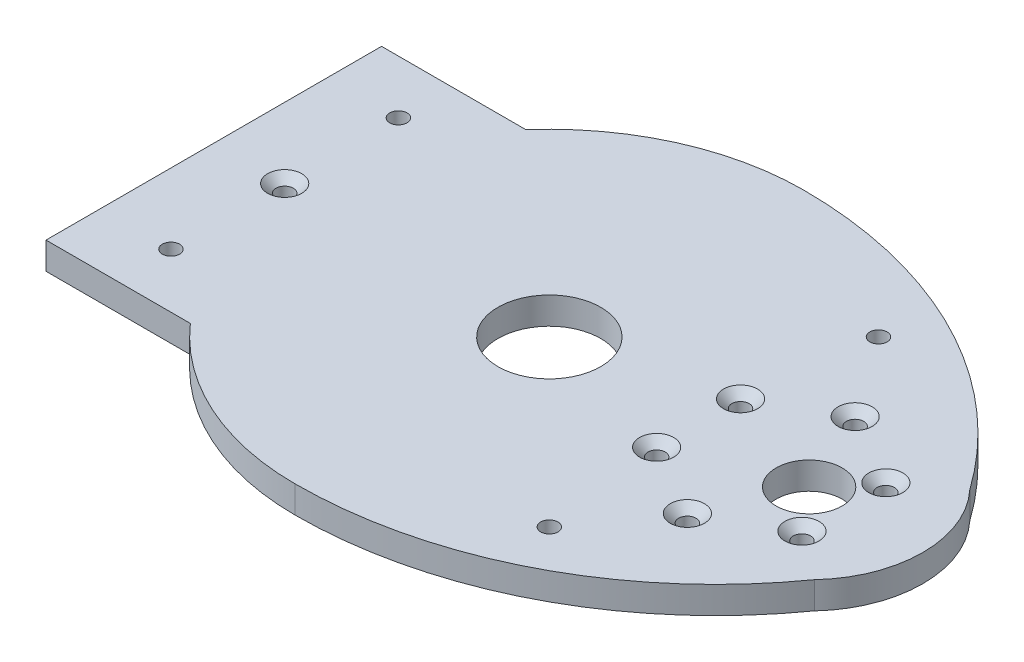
ISO-10303-21;
HEADER;
FILE_DESCRIPTION(('STEP AP214'),'2;1');
FILE_NAME('part.step','',(''),(''),'','','');
FILE_SCHEMA(('AUTOMOTIVE_DESIGN { 1 0 10303 214 1 1 1 1 }'));
ENDSEC;
DATA;
#1=APPLICATION_CONTEXT('core data for automotive mechanical design processes');
#2=APPLICATION_PROTOCOL_DEFINITION('international standard','automotive_design',2000,#1);
#3=PRODUCT_CONTEXT('',#1,'mechanical');
#4=PRODUCT('Part','Part','',(#3));
#5=PRODUCT_RELATED_PRODUCT_CATEGORY('part','',(#4));
#6=PRODUCT_DEFINITION_FORMATION('','',#4);
#7=PRODUCT_DEFINITION_CONTEXT('part definition',#1,'design');
#8=PRODUCT_DEFINITION('design','',#6,#7);
#9=PRODUCT_DEFINITION_SHAPE('','',#8);
#10=(LENGTH_UNIT() NAMED_UNIT(*) SI_UNIT(.MILLI.,.METRE.));
#11=(NAMED_UNIT(*) PLANE_ANGLE_UNIT() SI_UNIT($,.RADIAN.));
#12=(NAMED_UNIT(*) SI_UNIT($,.STERADIAN.) SOLID_ANGLE_UNIT());
#13=UNCERTAINTY_MEASURE_WITH_UNIT(LENGTH_MEASURE(1.E-05),#10,'distance_accuracy_value','');
#14=(GEOMETRIC_REPRESENTATION_CONTEXT(3) GLOBAL_UNCERTAINTY_ASSIGNED_CONTEXT((#13)) GLOBAL_UNIT_ASSIGNED_CONTEXT((#10,
#11,#12)) REPRESENTATION_CONTEXT('',''));
#15=CARTESIAN_POINT('',(0.,0.,0.));
#16=DIRECTION('',(0.,0.,1.));
#17=DIRECTION('',(1.,0.,0.));
#18=AXIS2_PLACEMENT_3D('',#15,#16,#17);
#19=CARTESIAN_POINT('',(0.,5.,30.7408522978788));
#20=DIRECTION('',(0.,-1.,0.));
#21=DIRECTION('',(0.,0.,-1.));
#22=AXIS2_PLACEMENT_3D('',#19,#20,#21);
#23=CYLINDRICAL_SURFACE('',#22,77.7408522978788);
#24=CARTESIAN_POINT('',(0.,0.,30.7408522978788));
#25=DIRECTION('',(0.,1.,0.));
#26=DIRECTION('',(0.,0.,1.));
#27=AXIS2_PLACEMENT_3D('',#24,#25,#26);
#28=CIRCLE('',#27,77.7408522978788);
#29=CARTESIAN_POINT('',(0.,0.,-47.));
#30=VERTEX_POINT('',#29);
#31=CARTESIAN_POINT('',(63.3152198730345,0.,-14.3681606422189));
#32=VERTEX_POINT('',#31);
#33=EDGE_CURVE('E151',#30,#32,#28,.F.);
#34=ORIENTED_EDGE('',*,*,#33,.F.);
#35=DIRECTION('',(0.,-1.,0.));
#36=VECTOR('',#35,1.);
#37=CARTESIAN_POINT('',(0.,5.,-47.));
#38=LINE('',#37,#36);
#39=CARTESIAN_POINT('',(0.,5.,-47.));
#40=VERTEX_POINT('',#39);
#41=EDGE_CURVE('E11',#40,#30,#38,.T.);
#42=ORIENTED_EDGE('',*,*,#41,.F.);
#43=CARTESIAN_POINT('',(0.,5.,30.7408522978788));
#44=DIRECTION('',(0.,1.,0.));
#45=DIRECTION('',(0.,0.,1.));
#46=AXIS2_PLACEMENT_3D('',#43,#44,#45);
#47=CIRCLE('',#46,77.7408522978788);
#48=CARTESIAN_POINT('',(63.3152198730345,5.,-14.3681606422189));
#49=VERTEX_POINT('',#48);
#50=EDGE_CURVE('E183',#40,#49,#47,.F.);
#51=ORIENTED_EDGE('',*,*,#50,.T.);
#52=DIRECTION('',(0.,-1.,0.));
#53=VECTOR('',#52,1.);
#54=CARTESIAN_POINT('',(63.3152198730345,5.,-14.3681606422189));
#55=LINE('',#54,#53);
#56=EDGE_CURVE('E94',#49,#32,#55,.T.);
#57=ORIENTED_EDGE('',*,*,#56,.T.);
#58=EDGE_LOOP('',(#34,#42,#51,#57));
#59=FACE_BOUND('',#58,.T.);
#60=ADVANCED_FACE('F40',(#59),#23,.T.);
#61=CARTESIAN_POINT('',(0.,5.,0.));
#62=DIRECTION('',(0.,-1.,0.));
#63=DIRECTION('',(0.,0.,-1.));
#64=AXIS2_PLACEMENT_3D('',#61,#62,#63);
#65=CYLINDRICAL_SURFACE('',#64,47.);
#66=CARTESIAN_POINT('',(0.,0.,0.));
#67=DIRECTION('',(0.,1.,0.));
#68=DIRECTION('',(0.,0.,1.));
#69=AXIS2_PLACEMENT_3D('',#66,#67,#68);
#70=CIRCLE('',#69,47.);
#71=CARTESIAN_POINT('',(-35.3270434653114,0.,-31.));
#72=VERTEX_POINT('',#71);
#73=EDGE_CURVE('E155',#30,#72,#70,.T.);
#74=ORIENTED_EDGE('',*,*,#73,.T.);
#75=DIRECTION('',(0.,-1.,0.));
#76=VECTOR('',#75,1.);
#77=CARTESIAN_POINT('',(-35.3270434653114,5.,-31.));
#78=LINE('',#77,#76);
#79=CARTESIAN_POINT('',(-35.3270434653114,5.,-31.));
#80=VERTEX_POINT('',#79);
#81=EDGE_CURVE('E50',#80,#72,#78,.T.);
#82=ORIENTED_EDGE('',*,*,#81,.F.);
#83=CARTESIAN_POINT('',(0.,5.,0.));
#84=DIRECTION('',(0.,1.,0.));
#85=DIRECTION('',(0.,0.,1.));
#86=AXIS2_PLACEMENT_3D('',#83,#84,#85);
#87=CIRCLE('',#86,47.);
#88=EDGE_CURVE('E126',#40,#80,#87,.T.);
#89=ORIENTED_EDGE('',*,*,#88,.F.);
#90=ORIENTED_EDGE('',*,*,#41,.T.);
#91=EDGE_LOOP('',(#74,#82,#89,#90));
#92=FACE_BOUND('',#91,.T.);
#93=ADVANCED_FACE('F290',(#92),#65,.T.);
#94=CARTESIAN_POINT('',(0.,5.,-31.));
#95=DIRECTION('',(0.,0.,-1.));
#96=DIRECTION('',(-1.,0.,0.));
#97=AXIS2_PLACEMENT_3D('',#94,#95,#96);
#98=PLANE('',#97);
#99=DIRECTION('',(1.,0.,0.));
#100=VECTOR('',#99,1.);
#101=CARTESIAN_POINT('',(0.,0.,-31.));
#102=LINE('',#101,#100);
#103=CARTESIAN_POINT('',(-62.,0.,-31.));
#104=VERTEX_POINT('',#103);
#105=EDGE_CURVE('E160',#104,#72,#102,.T.);
#106=ORIENTED_EDGE('',*,*,#105,.F.);
#107=DIRECTION('',(0.,-1.,0.));
#108=VECTOR('',#107,1.);
#109=CARTESIAN_POINT('',(-62.,5.,-31.));
#110=LINE('',#109,#108);
#111=CARTESIAN_POINT('',(-62.,5.,-31.));
#112=VERTEX_POINT('',#111);
#113=EDGE_CURVE('E194',#112,#104,#110,.T.);
#114=ORIENTED_EDGE('',*,*,#113,.F.);
#115=DIRECTION('',(1.,0.,0.));
#116=VECTOR('',#115,1.);
#117=CARTESIAN_POINT('',(0.,5.,-31.));
#118=LINE('',#117,#116);
#119=EDGE_CURVE('E265',#112,#80,#118,.T.);
#120=ORIENTED_EDGE('',*,*,#119,.T.);
#121=ORIENTED_EDGE('',*,*,#81,.T.);
#122=EDGE_LOOP('',(#106,#114,#120,#121));
#123=FACE_BOUND('',#122,.T.);
#124=ADVANCED_FACE('F293',(#123),#98,.T.);
#125=CARTESIAN_POINT('',(-62.,5.,0.));
#126=DIRECTION('',(1.,0.,0.));
#127=DIRECTION('',(0.,0.,-1.));
#128=AXIS2_PLACEMENT_3D('',#125,#126,#127);
#129=PLANE('',#128);
#130=DIRECTION('',(0.,0.,1.));
#131=VECTOR('',#130,1.);
#132=CARTESIAN_POINT('',(-62.,0.,0.));
#133=LINE('',#132,#131);
#134=CARTESIAN_POINT('',(-62.,0.,31.));
#135=VERTEX_POINT('',#134);
#136=EDGE_CURVE('E164',#104,#135,#133,.T.);
#137=ORIENTED_EDGE('',*,*,#136,.T.);
#138=DIRECTION('',(0.,-1.,0.));
#139=VECTOR('',#138,1.);
#140=CARTESIAN_POINT('',(-62.,5.,31.));
#141=LINE('',#140,#139);
#142=CARTESIAN_POINT('',(-62.,5.,31.));
#143=VERTEX_POINT('',#142);
#144=EDGE_CURVE('E190',#143,#135,#141,.T.);
#145=ORIENTED_EDGE('',*,*,#144,.F.);
#146=DIRECTION('',(0.,0.,1.));
#147=VECTOR('',#146,1.);
#148=CARTESIAN_POINT('',(-62.,5.,0.));
#149=LINE('',#148,#147);
#150=EDGE_CURVE('E268',#112,#143,#149,.T.);
#151=ORIENTED_EDGE('',*,*,#150,.F.);
#152=ORIENTED_EDGE('',*,*,#113,.T.);
#153=EDGE_LOOP('',(#137,#145,#151,#152));
#154=FACE_BOUND('',#153,.T.);
#155=ADVANCED_FACE('F275',(#154),#129,.F.);
#156=CARTESIAN_POINT('',(0.,5.,31.));
#157=DIRECTION('',(0.,0.,-1.));
#158=DIRECTION('',(-1.,0.,0.));
#159=AXIS2_PLACEMENT_3D('',#156,#157,#158);
#160=PLANE('',#159);
#161=DIRECTION('',(1.,0.,0.));
#162=VECTOR('',#161,1.);
#163=CARTESIAN_POINT('',(0.,0.,31.));
#164=LINE('',#163,#162);
#165=CARTESIAN_POINT('',(-35.3270434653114,0.,31.));
#166=VERTEX_POINT('',#165);
#167=EDGE_CURVE('E167',#135,#166,#164,.T.);
#168=ORIENTED_EDGE('',*,*,#167,.T.);
#169=DIRECTION('',(0.,-1.,0.));
#170=VECTOR('',#169,1.);
#171=CARTESIAN_POINT('',(-35.3270434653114,5.,31.));
#172=LINE('',#171,#170);
#173=CARTESIAN_POINT('',(-35.3270434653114,5.,31.));
#174=VERTEX_POINT('',#173);
#175=EDGE_CURVE('E132',#174,#166,#172,.T.);
#176=ORIENTED_EDGE('',*,*,#175,.F.);
#177=DIRECTION('',(1.,0.,0.));
#178=VECTOR('',#177,1.);
#179=CARTESIAN_POINT('',(0.,5.,31.));
#180=LINE('',#179,#178);
#181=EDGE_CURVE('E120',#143,#174,#180,.T.);
#182=ORIENTED_EDGE('',*,*,#181,.F.);
#183=ORIENTED_EDGE('',*,*,#144,.T.);
#184=EDGE_LOOP('',(#168,#176,#182,#183));
#185=FACE_BOUND('',#184,.T.);
#186=ADVANCED_FACE('F279',(#185),#160,.F.);
#187=CARTESIAN_POINT('',(0.,0.,47.));
#188=VERTEX_POINT('',#187);
#189=EDGE_CURVE('E130',#166,#188,#70,.T.);
#190=ORIENTED_EDGE('',*,*,#189,.T.);
#191=DIRECTION('',(0.,-1.,0.));
#192=VECTOR('',#191,1.);
#193=CARTESIAN_POINT('',(0.,5.,47.));
#194=LINE('',#193,#192);
#195=CARTESIAN_POINT('',(0.,5.,47.));
#196=VERTEX_POINT('',#195);
#197=EDGE_CURVE('E127',#196,#188,#194,.T.);
#198=ORIENTED_EDGE('',*,*,#197,.F.);
#199=EDGE_CURVE('E113',#174,#196,#87,.T.);
#200=ORIENTED_EDGE('',*,*,#199,.F.);
#201=ORIENTED_EDGE('',*,*,#175,.T.);
#202=EDGE_LOOP('',(#190,#198,#200,#201));
#203=FACE_BOUND('',#202,.T.);
#204=ADVANCED_FACE('F128',(#203),#65,.T.);
#205=CARTESIAN_POINT('',(0.,5.,-30.7408522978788));
#206=DIRECTION('',(0.,-1.,0.));
#207=DIRECTION('',(0.,0.,-1.));
#208=AXIS2_PLACEMENT_3D('',#205,#206,#207);
#209=CYLINDRICAL_SURFACE('',#208,77.7408522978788);
#210=CARTESIAN_POINT('',(0.,0.,-30.7408522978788));
#211=DIRECTION('',(0.,1.,0.));
#212=DIRECTION('',(0.,0.,1.));
#213=AXIS2_PLACEMENT_3D('',#210,#211,#212);
#214=CIRCLE('',#213,77.7408522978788);
#215=CARTESIAN_POINT('',(63.3152198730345,0.,14.3681606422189));
#216=VERTEX_POINT('',#215);
#217=EDGE_CURVE('E87',#188,#216,#214,.T.);
#218=ORIENTED_EDGE('',*,*,#217,.T.);
#219=DIRECTION('',(0.,-1.,0.));
#220=VECTOR('',#219,1.);
#221=CARTESIAN_POINT('',(63.3152198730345,5.,14.3681606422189));
#222=LINE('',#221,#220);
#223=CARTESIAN_POINT('',(63.3152198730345,5.,14.3681606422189));
#224=VERTEX_POINT('',#223);
#225=EDGE_CURVE('E133',#224,#216,#222,.T.);
#226=ORIENTED_EDGE('',*,*,#225,.F.);
#227=CARTESIAN_POINT('',(0.,5.,-30.7408522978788));
#228=DIRECTION('',(0.,1.,0.));
#229=DIRECTION('',(0.,0.,1.));
#230=AXIS2_PLACEMENT_3D('',#227,#228,#229);
#231=CIRCLE('',#230,77.7408522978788);
#232=EDGE_CURVE('E118',#196,#224,#231,.T.);
#233=ORIENTED_EDGE('',*,*,#232,.F.);
#234=ORIENTED_EDGE('',*,*,#197,.T.);
#235=EDGE_LOOP('',(#218,#226,#233,#234));
#236=FACE_BOUND('',#235,.T.);
#237=ADVANCED_FACE('F135',(#236),#209,.T.);
#238=CARTESIAN_POINT('',(0.,5.,0.));
#239=DIRECTION('',(0.,-1.,0.));
#240=DIRECTION('',(0.,0.,-1.));
#241=AXIS2_PLACEMENT_3D('',#238,#239,#240);
#242=CYLINDRICAL_SURFACE('',#241,9.5);
#243=CARTESIAN_POINT('',(0.,5.,0.));
#244=DIRECTION('',(0.,1.,0.));
#245=DIRECTION('',(0.,0.,1.));
#246=AXIS2_PLACEMENT_3D('',#243,#244,#245);
#247=CIRCLE('',#246,9.5);
#248=CARTESIAN_POINT('',(0.,5.,9.5));
#249=VERTEX_POINT('',#248);
#250=EDGE_CURVE('E139',#249,#249,#247,.T.);
#251=ORIENTED_EDGE('',*,*,#250,.T.);
#252=EDGE_LOOP('',(#251));
#253=FACE_BOUND('',#252,.T.);
#254=CARTESIAN_POINT('',(0.,0.,0.));
#255=DIRECTION('',(0.,1.,0.));
#256=DIRECTION('',(0.,0.,1.));
#257=AXIS2_PLACEMENT_3D('',#254,#255,#256);
#258=CIRCLE('',#257,9.5);
#259=CARTESIAN_POINT('',(0.,0.,9.5));
#260=VERTEX_POINT('',#259);
#261=EDGE_CURVE('E175',#260,#260,#258,.T.);
#262=ORIENTED_EDGE('',*,*,#261,.F.);
#263=EDGE_LOOP('',(#262));
#264=FACE_BOUND('',#263,.T.);
#265=ADVANCED_FACE('F344',(#253,#264),#242,.F.);
#266=CARTESIAN_POINT('',(48.,5.,0.));
#267=DIRECTION('',(0.,-1.,0.));
#268=DIRECTION('',(0.,0.,-1.));
#269=AXIS2_PLACEMENT_3D('',#266,#267,#268);
#270=CYLINDRICAL_SURFACE('',#269,21.);
#271=CARTESIAN_POINT('',(48.,0.,0.));
#272=DIRECTION('',(0.,1.,0.));
#273=DIRECTION('',(0.,0.,1.));
#274=AXIS2_PLACEMENT_3D('',#271,#272,#273);
#275=CIRCLE('',#274,21.);
#276=EDGE_CURVE('E172',#216,#32,#275,.T.);
#277=ORIENTED_EDGE('',*,*,#276,.T.);
#278=ORIENTED_EDGE('',*,*,#56,.F.);
#279=CARTESIAN_POINT('',(48.,5.,0.));
#280=DIRECTION('',(0.,1.,0.));
#281=DIRECTION('',(0.,0.,1.));
#282=AXIS2_PLACEMENT_3D('',#279,#280,#281);
#283=CIRCLE('',#282,21.);
#284=EDGE_CURVE('E59',#224,#49,#283,.T.);
#285=ORIENTED_EDGE('',*,*,#284,.F.);
#286=ORIENTED_EDGE('',*,*,#225,.T.);
#287=EDGE_LOOP('',(#277,#278,#285,#286));
#288=FACE_BOUND('',#287,.T.);
#289=ADVANCED_FACE('F287',(#288),#270,.T.);
#290=CARTESIAN_POINT('',(48.,5.,0.));
#291=DIRECTION('',(0.,-1.,0.));
#292=DIRECTION('',(0.,0.,-1.));
#293=AXIS2_PLACEMENT_3D('',#290,#291,#292);
#294=CYLINDRICAL_SURFACE('',#293,6.1);
#295=CARTESIAN_POINT('',(48.,5.,0.));
#296=DIRECTION('',(0.,1.,0.));
#297=DIRECTION('',(0.,0.,1.));
#298=AXIS2_PLACEMENT_3D('',#295,#296,#297);
#299=CIRCLE('',#298,6.1);
#300=CARTESIAN_POINT('',(48.,5.,6.1));
#301=VERTEX_POINT('',#300);
#302=EDGE_CURVE('E147',#301,#301,#299,.T.);
#303=ORIENTED_EDGE('',*,*,#302,.T.);
#304=EDGE_LOOP('',(#303));
#305=FACE_BOUND('',#304,.T.);
#306=CARTESIAN_POINT('',(48.,0.,0.));
#307=DIRECTION('',(0.,1.,0.));
#308=DIRECTION('',(0.,0.,1.));
#309=AXIS2_PLACEMENT_3D('',#306,#307,#308);
#310=CIRCLE('',#309,6.1);
#311=CARTESIAN_POINT('',(48.,0.,6.1));
#312=VERTEX_POINT('',#311);
#313=EDGE_CURVE('E179',#312,#312,#310,.T.);
#314=ORIENTED_EDGE('',*,*,#313,.F.);
#315=EDGE_LOOP('',(#314));
#316=FACE_BOUND('',#315,.T.);
#317=ADVANCED_FACE('F362',(#305,#316),#294,.F.);
#318=CARTESIAN_POINT('',(0.,5.,0.));
#319=DIRECTION('',(0.,1.,0.));
#320=DIRECTION('',(0.,0.,1.));
#321=AXIS2_PLACEMENT_3D('',#318,#319,#320);
#322=PLANE('',#321);
#323=CARTESIAN_POINT('',(-49.,5.,-0.0999999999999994));
#324=DIRECTION('',(0.,1.,0.));
#325=DIRECTION('',(0.,0.,1.));
#326=AXIS2_PLACEMENT_3D('',#323,#324,#325);
#327=CIRCLE('',#326,3.15);
#328=CARTESIAN_POINT('',(-49.,5.,3.05));
#329=VERTEX_POINT('',#328);
#330=EDGE_CURVE('E602',#329,#329,#327,.T.);
#331=ORIENTED_EDGE('',*,*,#330,.F.);
#332=EDGE_LOOP('',(#331));
#333=FACE_BOUND('',#332,.T.);
#334=CARTESIAN_POINT('',(-49.,5.,-21.11));
#335=DIRECTION('',(0.,-1.,0.));
#336=DIRECTION('',(0.,0.,-1.));
#337=AXIS2_PLACEMENT_3D('',#334,#335,#336);
#338=CIRCLE('',#337,1.6);
#339=CARTESIAN_POINT('',(-49.,5.,-22.71));
#340=VERTEX_POINT('',#339);
#341=EDGE_CURVE('E609',#340,#340,#338,.T.);
#342=ORIENTED_EDGE('',*,*,#341,.T.);
#343=EDGE_LOOP('',(#342));
#344=FACE_BOUND('',#343,.T.);
#345=CARTESIAN_POINT('',(-49.,5.,20.91));
#346=DIRECTION('',(0.,-1.,0.));
#347=DIRECTION('',(0.,0.,-1.));
#348=AXIS2_PLACEMENT_3D('',#345,#346,#347);
#349=CIRCLE('',#348,1.6);
#350=CARTESIAN_POINT('',(-49.,5.,19.31));
#351=VERTEX_POINT('',#350);
#352=EDGE_CURVE('E618',#351,#351,#349,.T.);
#353=ORIENTED_EDGE('',*,*,#352,.T.);
#354=EDGE_LOOP('',(#353));
#355=FACE_BOUND('',#354,.T.);
#356=CARTESIAN_POINT('',(30.4055915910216,5.,30.4055915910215));
#357=DIRECTION('',(0.,-1.,0.));
#358=DIRECTION('',(0.,0.,-1.));
#359=AXIS2_PLACEMENT_3D('',#356,#357,#358);
#360=CIRCLE('',#359,1.6);
#361=CARTESIAN_POINT('',(30.4055915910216,5.,28.8055915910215));
#362=VERTEX_POINT('',#361);
#363=EDGE_CURVE('E636',#362,#362,#360,.T.);
#364=ORIENTED_EDGE('',*,*,#363,.T.);
#365=EDGE_LOOP('',(#364));
#366=FACE_BOUND('',#365,.T.);
#367=CARTESIAN_POINT('',(30.4055915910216,5.,-30.4055915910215));
#368=DIRECTION('',(0.,-1.,0.));
#369=DIRECTION('',(0.,0.,-1.));
#370=AXIS2_PLACEMENT_3D('',#367,#368,#369);
#371=CIRCLE('',#370,1.6);
#372=CARTESIAN_POINT('',(30.4055915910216,5.,-32.0055915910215));
#373=VERTEX_POINT('',#372);
#374=EDGE_CURVE('E648',#373,#373,#371,.T.);
#375=ORIENTED_EDGE('',*,*,#374,.T.);
#376=EDGE_LOOP('',(#375));
#377=FACE_BOUND('',#376,.T.);
#378=CARTESIAN_POINT('',(27.5766062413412,5.,-7.75000000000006));
#379=DIRECTION('',(0.,1.,0.));
#380=DIRECTION('',(0.,0.,1.));
#381=AXIS2_PLACEMENT_3D('',#378,#379,#380);
#382=CIRCLE('',#381,3.15);
#383=CARTESIAN_POINT('',(27.5766062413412,5.,-4.60000000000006));
#384=VERTEX_POINT('',#383);
#385=EDGE_CURVE('E652',#384,#384,#382,.T.);
#386=ORIENTED_EDGE('',*,*,#385,.F.);
#387=EDGE_LOOP('',(#386));
#388=FACE_BOUND('',#387,.T.);
#389=CARTESIAN_POINT('',(41.0000000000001,5.,-15.5));
#390=DIRECTION('',(0.,1.,0.));
#391=DIRECTION('',(0.,0.,1.));
#392=AXIS2_PLACEMENT_3D('',#389,#390,#391);
#393=CIRCLE('',#392,3.15);
#394=CARTESIAN_POINT('',(41.0000000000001,5.,-12.35));
#395=VERTEX_POINT('',#394);
#396=EDGE_CURVE('E232',#395,#395,#393,.T.);
#397=ORIENTED_EDGE('',*,*,#396,.F.);
#398=EDGE_LOOP('',(#397));
#399=FACE_BOUND('',#398,.T.);
#400=CARTESIAN_POINT('',(27.5766062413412,5.,7.74999999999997));
#401=DIRECTION('',(0.,1.,0.));
#402=DIRECTION('',(0.,0.,1.));
#403=AXIS2_PLACEMENT_3D('',#400,#401,#402);
#404=CIRCLE('',#403,3.15);
#405=CARTESIAN_POINT('',(27.5766062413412,5.,10.9));
#406=VERTEX_POINT('',#405);
#407=EDGE_CURVE('E223',#406,#406,#404,.T.);
#408=ORIENTED_EDGE('',*,*,#407,.F.);
#409=EDGE_LOOP('',(#408));
#410=FACE_BOUND('',#409,.T.);
#411=CARTESIAN_POINT('',(41.,5.,15.5));
#412=DIRECTION('',(0.,1.,0.));
#413=DIRECTION('',(0.,0.,1.));
#414=AXIS2_PLACEMENT_3D('',#411,#412,#413);
#415=CIRCLE('',#414,3.15);
#416=CARTESIAN_POINT('',(41.,5.,18.65));
#417=VERTEX_POINT('',#416);
#418=EDGE_CURVE('E218',#417,#417,#415,.T.);
#419=ORIENTED_EDGE('',*,*,#418,.F.);
#420=EDGE_LOOP('',(#419));
#421=FACE_BOUND('',#420,.T.);
#422=CARTESIAN_POINT('',(54.4233937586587,5.,7.75000000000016));
#423=DIRECTION('',(0.,1.,0.));
#424=DIRECTION('',(0.,0.,1.));
#425=AXIS2_PLACEMENT_3D('',#422,#423,#424);
#426=CIRCLE('',#425,3.15);
#427=CARTESIAN_POINT('',(54.4233937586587,5.,10.9000000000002));
#428=VERTEX_POINT('',#427);
#429=EDGE_CURVE('E213',#428,#428,#426,.T.);
#430=ORIENTED_EDGE('',*,*,#429,.F.);
#431=EDGE_LOOP('',(#430));
#432=FACE_BOUND('',#431,.T.);
#433=CARTESIAN_POINT('',(54.4233937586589,5.,-7.74999999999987));
#434=DIRECTION('',(0.,1.,0.));
#435=DIRECTION('',(0.,0.,1.));
#436=AXIS2_PLACEMENT_3D('',#433,#434,#435);
#437=CIRCLE('',#436,3.15);
#438=CARTESIAN_POINT('',(54.4233937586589,5.,-4.59999999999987));
#439=VERTEX_POINT('',#438);
#440=EDGE_CURVE('E207',#439,#439,#437,.T.);
#441=ORIENTED_EDGE('',*,*,#440,.F.);
#442=EDGE_LOOP('',(#441));
#443=FACE_BOUND('',#442,.T.);
#444=ORIENTED_EDGE('',*,*,#50,.F.);
#445=ORIENTED_EDGE('',*,*,#88,.T.);
#446=ORIENTED_EDGE('',*,*,#119,.F.);
#447=ORIENTED_EDGE('',*,*,#150,.T.);
#448=ORIENTED_EDGE('',*,*,#181,.T.);
#449=ORIENTED_EDGE('',*,*,#199,.T.);
#450=ORIENTED_EDGE('',*,*,#232,.T.);
#451=ORIENTED_EDGE('',*,*,#284,.T.);
#452=EDGE_LOOP('',(#444,#445,#446,#447,#448,#449,#450,#451));
#453=FACE_BOUND('',#452,.T.);
#454=ORIENTED_EDGE('',*,*,#250,.F.);
#455=EDGE_LOOP('',(#454));
#456=FACE_BOUND('',#455,.T.);
#457=ORIENTED_EDGE('',*,*,#302,.F.);
#458=EDGE_LOOP('',(#457));
#459=FACE_BOUND('',#458,.T.);
#460=ADVANCED_FACE('F115',(#333,#344,#355,#366,#377,#388,#399,#410,#421,#432,#443,#453,#456,
#459),#322,.T.);
#461=CARTESIAN_POINT('',(0.,0.,0.));
#462=DIRECTION('',(0.,1.,0.));
#463=DIRECTION('',(0.,0.,1.));
#464=AXIS2_PLACEMENT_3D('',#461,#462,#463);
#465=PLANE('',#464);
#466=CARTESIAN_POINT('',(-49.,0.,-21.11));
#467=DIRECTION('',(0.,-1.,0.));
#468=DIRECTION('',(0.,0.,-1.));
#469=AXIS2_PLACEMENT_3D('',#466,#467,#468);
#470=CIRCLE('',#469,1.6);
#471=CARTESIAN_POINT('',(-49.,0.,-22.71));
#472=VERTEX_POINT('',#471);
#473=EDGE_CURVE('E614',#472,#472,#470,.T.);
#474=ORIENTED_EDGE('',*,*,#473,.F.);
#475=EDGE_LOOP('',(#474));
#476=FACE_BOUND('',#475,.T.);
#477=CARTESIAN_POINT('',(-49.,0.,20.91));
#478=DIRECTION('',(0.,-1.,0.));
#479=DIRECTION('',(0.,0.,-1.));
#480=AXIS2_PLACEMENT_3D('',#477,#478,#479);
#481=CIRCLE('',#480,1.6);
#482=CARTESIAN_POINT('',(-49.,0.,19.31));
#483=VERTEX_POINT('',#482);
#484=EDGE_CURVE('E622',#483,#483,#481,.T.);
#485=ORIENTED_EDGE('',*,*,#484,.F.);
#486=EDGE_LOOP('',(#485));
#487=FACE_BOUND('',#486,.T.);
#488=CARTESIAN_POINT('',(-49.,0.,-0.0999999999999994));
#489=DIRECTION('',(0.,-1.,0.));
#490=DIRECTION('',(0.,0.,-1.));
#491=AXIS2_PLACEMENT_3D('',#488,#489,#490);
#492=CIRCLE('',#491,1.6);
#493=CARTESIAN_POINT('',(-49.,0.,-1.7));
#494=VERTEX_POINT('',#493);
#495=EDGE_CURVE('E606',#494,#494,#492,.T.);
#496=ORIENTED_EDGE('',*,*,#495,.F.);
#497=EDGE_LOOP('',(#496));
#498=FACE_BOUND('',#497,.T.);
#499=CARTESIAN_POINT('',(30.4055915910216,0.,30.4055915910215));
#500=DIRECTION('',(0.,-1.,0.));
#501=DIRECTION('',(0.,0.,-1.));
#502=AXIS2_PLACEMENT_3D('',#499,#500,#501);
#503=CIRCLE('',#502,3.15);
#504=CARTESIAN_POINT('',(30.4055915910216,0.,27.2555915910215));
#505=VERTEX_POINT('',#504);
#506=EDGE_CURVE('E613',#505,#505,#503,.T.);
#507=ORIENTED_EDGE('',*,*,#506,.F.);
#508=EDGE_LOOP('',(#507));
#509=FACE_BOUND('',#508,.T.);
#510=CARTESIAN_POINT('',(30.4055915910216,0.,-30.4055915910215));
#511=DIRECTION('',(0.,-1.,0.));
#512=DIRECTION('',(0.,0.,-1.));
#513=AXIS2_PLACEMENT_3D('',#510,#511,#512);
#514=CIRCLE('',#513,3.15);
#515=CARTESIAN_POINT('',(30.4055915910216,0.,-33.5555915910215));
#516=VERTEX_POINT('',#515);
#517=EDGE_CURVE('E640',#516,#516,#514,.T.);
#518=ORIENTED_EDGE('',*,*,#517,.F.);
#519=EDGE_LOOP('',(#518));
#520=FACE_BOUND('',#519,.T.);
#521=CARTESIAN_POINT('',(27.5766062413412,0.,-7.75000000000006));
#522=DIRECTION('',(0.,1.,0.));
#523=DIRECTION('',(0.,0.,1.));
#524=AXIS2_PLACEMENT_3D('',#521,#522,#523);
#525=CIRCLE('',#524,1.6);
#526=CARTESIAN_POINT('',(27.5766062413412,0.,-6.15000000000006));
#527=VERTEX_POINT('',#526);
#528=EDGE_CURVE('E43',#527,#527,#525,.T.);
#529=ORIENTED_EDGE('',*,*,#528,.T.);
#530=EDGE_LOOP('',(#529));
#531=FACE_BOUND('',#530,.T.);
#532=CARTESIAN_POINT('',(41.0000000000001,0.,-15.5));
#533=DIRECTION('',(0.,1.,0.));
#534=DIRECTION('',(0.,0.,1.));
#535=AXIS2_PLACEMENT_3D('',#532,#533,#534);
#536=CIRCLE('',#535,1.6);
#537=CARTESIAN_POINT('',(41.0000000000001,0.,-13.9));
#538=VERTEX_POINT('',#537);
#539=EDGE_CURVE('E220',#538,#538,#536,.T.);
#540=ORIENTED_EDGE('',*,*,#539,.T.);
#541=EDGE_LOOP('',(#540));
#542=FACE_BOUND('',#541,.T.);
#543=CARTESIAN_POINT('',(27.5766062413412,0.,7.74999999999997));
#544=DIRECTION('',(0.,1.,0.));
#545=DIRECTION('',(0.,0.,1.));
#546=AXIS2_PLACEMENT_3D('',#543,#544,#545);
#547=CIRCLE('',#546,1.6);
#548=CARTESIAN_POINT('',(27.5766062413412,0.,9.34999999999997));
#549=VERTEX_POINT('',#548);
#550=EDGE_CURVE('E215',#549,#549,#547,.T.);
#551=ORIENTED_EDGE('',*,*,#550,.T.);
#552=EDGE_LOOP('',(#551));
#553=FACE_BOUND('',#552,.T.);
#554=CARTESIAN_POINT('',(41.,0.,15.5));
#555=DIRECTION('',(0.,1.,0.));
#556=DIRECTION('',(0.,0.,1.));
#557=AXIS2_PLACEMENT_3D('',#554,#555,#556);
#558=CIRCLE('',#557,1.6);
#559=CARTESIAN_POINT('',(41.,0.,17.1));
#560=VERTEX_POINT('',#559);
#561=EDGE_CURVE('E209',#560,#560,#558,.T.);
#562=ORIENTED_EDGE('',*,*,#561,.T.);
#563=EDGE_LOOP('',(#562));
#564=FACE_BOUND('',#563,.T.);
#565=CARTESIAN_POINT('',(54.4233937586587,0.,7.75000000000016));
#566=DIRECTION('',(0.,1.,0.));
#567=DIRECTION('',(0.,0.,1.));
#568=AXIS2_PLACEMENT_3D('',#565,#566,#567);
#569=CIRCLE('',#568,1.6);
#570=CARTESIAN_POINT('',(54.4233937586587,0.,9.35000000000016));
#571=VERTEX_POINT('',#570);
#572=EDGE_CURVE('E203',#571,#571,#569,.T.);
#573=ORIENTED_EDGE('',*,*,#572,.T.);
#574=EDGE_LOOP('',(#573));
#575=FACE_BOUND('',#574,.T.);
#576=CARTESIAN_POINT('',(54.4233937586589,0.,-7.74999999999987));
#577=DIRECTION('',(0.,1.,0.));
#578=DIRECTION('',(0.,0.,1.));
#579=AXIS2_PLACEMENT_3D('',#576,#577,#578);
#580=CIRCLE('',#579,1.6);
#581=CARTESIAN_POINT('',(54.4233937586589,0.,-6.14999999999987));
#582=VERTEX_POINT('',#581);
#583=EDGE_CURVE('E156',#582,#582,#580,.T.);
#584=ORIENTED_EDGE('',*,*,#583,.T.);
#585=EDGE_LOOP('',(#584));
#586=FACE_BOUND('',#585,.T.);
#587=ORIENTED_EDGE('',*,*,#33,.T.);
#588=ORIENTED_EDGE('',*,*,#276,.F.);
#589=ORIENTED_EDGE('',*,*,#217,.F.);
#590=ORIENTED_EDGE('',*,*,#189,.F.);
#591=ORIENTED_EDGE('',*,*,#167,.F.);
#592=ORIENTED_EDGE('',*,*,#136,.F.);
#593=ORIENTED_EDGE('',*,*,#105,.T.);
#594=ORIENTED_EDGE('',*,*,#73,.F.);
#595=EDGE_LOOP('',(#587,#588,#589,#590,#591,#592,#593,#594));
#596=FACE_BOUND('',#595,.T.);
#597=ORIENTED_EDGE('',*,*,#261,.T.);
#598=EDGE_LOOP('',(#597));
#599=FACE_BOUND('',#598,.T.);
#600=ORIENTED_EDGE('',*,*,#313,.T.);
#601=EDGE_LOOP('',(#600));
#602=FACE_BOUND('',#601,.T.);
#603=ADVANCED_FACE('F281',(#476,#487,#498,#509,#520,#531,#542,#553,#564,#575,#586,#596,#599,
#602),#465,.F.);
#604=CARTESIAN_POINT('',(54.4233937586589,5.,-7.74999999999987));
#605=DIRECTION('',(0.,1.,0.));
#606=DIRECTION('',(0.,0.,1.));
#607=AXIS2_PLACEMENT_3D('',#604,#605,#606);
#608=CYLINDRICAL_SURFACE('',#607,1.6);
#609=CARTESIAN_POINT('',(54.4233937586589,3.45,-7.74999999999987));
#610=DIRECTION('',(0.,1.,0.));
#611=DIRECTION('',(0.,0.,1.));
#612=AXIS2_PLACEMENT_3D('',#609,#610,#611);
#613=CIRCLE('',#612,1.6);
#614=CARTESIAN_POINT('',(54.4233937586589,3.45,-6.14999999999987));
#615=VERTEX_POINT('',#614);
#616=EDGE_CURVE('E202',#615,#615,#613,.T.);
#617=ORIENTED_EDGE('',*,*,#616,.T.);
#618=EDGE_LOOP('',(#617));
#619=FACE_BOUND('',#618,.T.);
#620=ORIENTED_EDGE('',*,*,#583,.F.);
#621=EDGE_LOOP('',(#620));
#622=FACE_BOUND('',#621,.T.);
#623=ADVANCED_FACE('F378',(#619,#622),#608,.F.);
#624=CARTESIAN_POINT('',(54.4233937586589,5.,-7.74999999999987));
#625=DIRECTION('',(0.,1.,0.));
#626=DIRECTION('',(0.,0.,1.));
#627=AXIS2_PLACEMENT_3D('',#624,#625,#626);
#628=CONICAL_SURFACE('',#627,3.15,0.785398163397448);
#629=ORIENTED_EDGE('',*,*,#616,.F.);
#630=EDGE_LOOP('',(#629));
#631=FACE_BOUND('',#630,.T.);
#632=ORIENTED_EDGE('',*,*,#440,.T.);
#633=EDGE_LOOP('',(#632));
#634=FACE_BOUND('',#633,.T.);
#635=ADVANCED_FACE('F383',(#631,#634),#628,.F.);
#636=CARTESIAN_POINT('',(54.4233937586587,5.,7.75000000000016));
#637=DIRECTION('',(0.,1.,0.));
#638=DIRECTION('',(0.,0.,1.));
#639=AXIS2_PLACEMENT_3D('',#636,#637,#638);
#640=CYLINDRICAL_SURFACE('',#639,1.6);
#641=CARTESIAN_POINT('',(54.4233937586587,3.45,7.75000000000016));
#642=DIRECTION('',(0.,1.,0.));
#643=DIRECTION('',(0.,0.,1.));
#644=AXIS2_PLACEMENT_3D('',#641,#642,#643);
#645=CIRCLE('',#644,1.6);
#646=CARTESIAN_POINT('',(54.4233937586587,3.45,9.35000000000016));
#647=VERTEX_POINT('',#646);
#648=EDGE_CURVE('E208',#647,#647,#645,.T.);
#649=ORIENTED_EDGE('',*,*,#648,.T.);
#650=EDGE_LOOP('',(#649));
#651=FACE_BOUND('',#650,.T.);
#652=ORIENTED_EDGE('',*,*,#572,.F.);
#653=EDGE_LOOP('',(#652));
#654=FACE_BOUND('',#653,.T.);
#655=ADVANCED_FACE('F395',(#651,#654),#640,.F.);
#656=CARTESIAN_POINT('',(54.4233937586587,5.,7.75000000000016));
#657=DIRECTION('',(0.,1.,0.));
#658=DIRECTION('',(0.,0.,1.));
#659=AXIS2_PLACEMENT_3D('',#656,#657,#658);
#660=CONICAL_SURFACE('',#659,3.15,0.785398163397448);
#661=ORIENTED_EDGE('',*,*,#648,.F.);
#662=EDGE_LOOP('',(#661));
#663=FACE_BOUND('',#662,.T.);
#664=ORIENTED_EDGE('',*,*,#429,.T.);
#665=EDGE_LOOP('',(#664));
#666=FACE_BOUND('',#665,.T.);
#667=ADVANCED_FACE('F405',(#663,#666),#660,.F.);
#668=CARTESIAN_POINT('',(41.,5.,15.5));
#669=DIRECTION('',(0.,1.,0.));
#670=DIRECTION('',(0.,0.,1.));
#671=AXIS2_PLACEMENT_3D('',#668,#669,#670);
#672=CYLINDRICAL_SURFACE('',#671,1.6);
#673=CARTESIAN_POINT('',(41.,3.45,15.5));
#674=DIRECTION('',(0.,1.,0.));
#675=DIRECTION('',(0.,0.,1.));
#676=AXIS2_PLACEMENT_3D('',#673,#674,#675);
#677=CIRCLE('',#676,1.6);
#678=CARTESIAN_POINT('',(41.,3.45,17.1));
#679=VERTEX_POINT('',#678);
#680=EDGE_CURVE('E214',#679,#679,#677,.T.);
#681=ORIENTED_EDGE('',*,*,#680,.T.);
#682=EDGE_LOOP('',(#681));
#683=FACE_BOUND('',#682,.T.);
#684=ORIENTED_EDGE('',*,*,#561,.F.);
#685=EDGE_LOOP('',(#684));
#686=FACE_BOUND('',#685,.T.);
#687=ADVANCED_FACE('F415',(#683,#686),#672,.F.);
#688=CARTESIAN_POINT('',(41.,5.,15.5));
#689=DIRECTION('',(0.,1.,0.));
#690=DIRECTION('',(0.,0.,1.));
#691=AXIS2_PLACEMENT_3D('',#688,#689,#690);
#692=CONICAL_SURFACE('',#691,3.15,0.785398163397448);
#693=ORIENTED_EDGE('',*,*,#680,.F.);
#694=EDGE_LOOP('',(#693));
#695=FACE_BOUND('',#694,.T.);
#696=ORIENTED_EDGE('',*,*,#418,.T.);
#697=EDGE_LOOP('',(#696));
#698=FACE_BOUND('',#697,.T.);
#699=ADVANCED_FACE('F425',(#695,#698),#692,.F.);
#700=CARTESIAN_POINT('',(27.5766062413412,5.,7.74999999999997));
#701=DIRECTION('',(0.,1.,0.));
#702=DIRECTION('',(0.,0.,1.));
#703=AXIS2_PLACEMENT_3D('',#700,#701,#702);
#704=CYLINDRICAL_SURFACE('',#703,1.6);
#705=CARTESIAN_POINT('',(27.5766062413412,3.45,7.74999999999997));
#706=DIRECTION('',(0.,1.,0.));
#707=DIRECTION('',(0.,0.,1.));
#708=AXIS2_PLACEMENT_3D('',#705,#706,#707);
#709=CIRCLE('',#708,1.6);
#710=CARTESIAN_POINT('',(27.5766062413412,3.45,9.34999999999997));
#711=VERTEX_POINT('',#710);
#712=EDGE_CURVE('E219',#711,#711,#709,.T.);
#713=ORIENTED_EDGE('',*,*,#712,.T.);
#714=EDGE_LOOP('',(#713));
#715=FACE_BOUND('',#714,.T.);
#716=ORIENTED_EDGE('',*,*,#550,.F.);
#717=EDGE_LOOP('',(#716));
#718=FACE_BOUND('',#717,.T.);
#719=ADVANCED_FACE('F435',(#715,#718),#704,.F.);
#720=CARTESIAN_POINT('',(27.5766062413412,5.,7.74999999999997));
#721=DIRECTION('',(0.,1.,0.));
#722=DIRECTION('',(0.,0.,1.));
#723=AXIS2_PLACEMENT_3D('',#720,#721,#722);
#724=CONICAL_SURFACE('',#723,3.15,0.785398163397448);
#725=ORIENTED_EDGE('',*,*,#712,.F.);
#726=EDGE_LOOP('',(#725));
#727=FACE_BOUND('',#726,.T.);
#728=ORIENTED_EDGE('',*,*,#407,.T.);
#729=EDGE_LOOP('',(#728));
#730=FACE_BOUND('',#729,.T.);
#731=ADVANCED_FACE('F445',(#727,#730),#724,.F.);
#732=CARTESIAN_POINT('',(41.0000000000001,5.,-15.5));
#733=DIRECTION('',(0.,1.,0.));
#734=DIRECTION('',(0.,0.,1.));
#735=AXIS2_PLACEMENT_3D('',#732,#733,#734);
#736=CYLINDRICAL_SURFACE('',#735,1.6);
#737=CARTESIAN_POINT('',(41.0000000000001,3.45,-15.5));
#738=DIRECTION('',(0.,1.,0.));
#739=DIRECTION('',(0.,0.,1.));
#740=AXIS2_PLACEMENT_3D('',#737,#738,#739);
#741=CIRCLE('',#740,1.6);
#742=CARTESIAN_POINT('',(41.0000000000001,3.45,-13.9));
#743=VERTEX_POINT('',#742);
#744=EDGE_CURVE('E224',#743,#743,#741,.T.);
#745=ORIENTED_EDGE('',*,*,#744,.T.);
#746=EDGE_LOOP('',(#745));
#747=FACE_BOUND('',#746,.T.);
#748=ORIENTED_EDGE('',*,*,#539,.F.);
#749=EDGE_LOOP('',(#748));
#750=FACE_BOUND('',#749,.T.);
#751=ADVANCED_FACE('F455',(#747,#750),#736,.F.);
#752=CARTESIAN_POINT('',(41.0000000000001,5.,-15.5));
#753=DIRECTION('',(0.,1.,0.));
#754=DIRECTION('',(0.,0.,1.));
#755=AXIS2_PLACEMENT_3D('',#752,#753,#754);
#756=CONICAL_SURFACE('',#755,3.15,0.785398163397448);
#757=ORIENTED_EDGE('',*,*,#744,.F.);
#758=EDGE_LOOP('',(#757));
#759=FACE_BOUND('',#758,.T.);
#760=ORIENTED_EDGE('',*,*,#396,.T.);
#761=EDGE_LOOP('',(#760));
#762=FACE_BOUND('',#761,.T.);
#763=ADVANCED_FACE('F465',(#759,#762),#756,.F.);
#764=CARTESIAN_POINT('',(27.5766062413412,5.,-7.75000000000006));
#765=DIRECTION('',(0.,1.,0.));
#766=DIRECTION('',(0.,0.,1.));
#767=AXIS2_PLACEMENT_3D('',#764,#765,#766);
#768=CYLINDRICAL_SURFACE('',#767,1.6);
#769=CARTESIAN_POINT('',(27.5766062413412,3.45,-7.75000000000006));
#770=DIRECTION('',(0.,1.,0.));
#771=DIRECTION('',(0.,0.,1.));
#772=AXIS2_PLACEMENT_3D('',#769,#770,#771);
#773=CIRCLE('',#772,1.6);
#774=CARTESIAN_POINT('',(27.5766062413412,3.45,-6.15000000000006));
#775=VERTEX_POINT('',#774);
#776=EDGE_CURVE('E655',#775,#775,#773,.T.);
#777=ORIENTED_EDGE('',*,*,#776,.T.);
#778=EDGE_LOOP('',(#777));
#779=FACE_BOUND('',#778,.T.);
#780=ORIENTED_EDGE('',*,*,#528,.F.);
#781=EDGE_LOOP('',(#780));
#782=FACE_BOUND('',#781,.T.);
#783=ADVANCED_FACE('F474',(#779,#782),#768,.F.);
#784=CARTESIAN_POINT('',(27.5766062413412,5.,-7.75000000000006));
#785=DIRECTION('',(0.,1.,0.));
#786=DIRECTION('',(0.,0.,1.));
#787=AXIS2_PLACEMENT_3D('',#784,#785,#786);
#788=CONICAL_SURFACE('',#787,3.15,0.785398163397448);
#789=ORIENTED_EDGE('',*,*,#776,.F.);
#790=EDGE_LOOP('',(#789));
#791=FACE_BOUND('',#790,.T.);
#792=ORIENTED_EDGE('',*,*,#385,.T.);
#793=EDGE_LOOP('',(#792));
#794=FACE_BOUND('',#793,.T.);
#795=ADVANCED_FACE('F484',(#791,#794),#788,.F.);
#796=CARTESIAN_POINT('',(30.4055915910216,0.,-30.4055915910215));
#797=DIRECTION('',(0.,-1.,0.));
#798=DIRECTION('',(0.,0.,-1.));
#799=AXIS2_PLACEMENT_3D('',#796,#797,#798);
#800=CYLINDRICAL_SURFACE('',#799,1.6);
#801=ORIENTED_EDGE('',*,*,#374,.F.);
#802=EDGE_LOOP('',(#801));
#803=FACE_BOUND('',#802,.T.);
#804=CARTESIAN_POINT('',(30.4055915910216,1.55,-30.4055915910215));
#805=DIRECTION('',(0.,-1.,0.));
#806=DIRECTION('',(0.,0.,-1.));
#807=AXIS2_PLACEMENT_3D('',#804,#805,#806);
#808=CIRCLE('',#807,1.6);
#809=CARTESIAN_POINT('',(30.4055915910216,1.55,-32.0055915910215));
#810=VERTEX_POINT('',#809);
#811=EDGE_CURVE('E644',#810,#810,#808,.T.);
#812=ORIENTED_EDGE('',*,*,#811,.T.);
#813=EDGE_LOOP('',(#812));
#814=FACE_BOUND('',#813,.T.);
#815=ADVANCED_FACE('F494',(#803,#814),#800,.F.);
#816=CARTESIAN_POINT('',(30.4055915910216,0.,-30.4055915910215));
#817=DIRECTION('',(0.,-1.,0.));
#818=DIRECTION('',(0.,0.,-1.));
#819=AXIS2_PLACEMENT_3D('',#816,#817,#818);
#820=CONICAL_SURFACE('',#819,3.15,0.785398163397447);
#821=ORIENTED_EDGE('',*,*,#811,.F.);
#822=EDGE_LOOP('',(#821));
#823=FACE_BOUND('',#822,.T.);
#824=ORIENTED_EDGE('',*,*,#517,.T.);
#825=EDGE_LOOP('',(#824));
#826=FACE_BOUND('',#825,.T.);
#827=ADVANCED_FACE('F504',(#823,#826),#820,.F.);
#828=CARTESIAN_POINT('',(30.4055915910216,0.,30.4055915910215));
#829=DIRECTION('',(0.,-1.,0.));
#830=DIRECTION('',(0.,0.,-1.));
#831=AXIS2_PLACEMENT_3D('',#828,#829,#830);
#832=CYLINDRICAL_SURFACE('',#831,1.6);
#833=ORIENTED_EDGE('',*,*,#363,.F.);
#834=EDGE_LOOP('',(#833));
#835=FACE_BOUND('',#834,.T.);
#836=CARTESIAN_POINT('',(30.4055915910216,1.55,30.4055915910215));
#837=DIRECTION('',(0.,-1.,0.));
#838=DIRECTION('',(0.,0.,-1.));
#839=AXIS2_PLACEMENT_3D('',#836,#837,#838);
#840=CIRCLE('',#839,1.6);
#841=CARTESIAN_POINT('',(30.4055915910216,1.55,28.8055915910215));
#842=VERTEX_POINT('',#841);
#843=EDGE_CURVE('E632',#842,#842,#840,.T.);
#844=ORIENTED_EDGE('',*,*,#843,.T.);
#845=EDGE_LOOP('',(#844));
#846=FACE_BOUND('',#845,.T.);
#847=ADVANCED_FACE('F514',(#835,#846),#832,.F.);
#848=CARTESIAN_POINT('',(30.4055915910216,0.,30.4055915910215));
#849=DIRECTION('',(0.,-1.,0.));
#850=DIRECTION('',(0.,0.,-1.));
#851=AXIS2_PLACEMENT_3D('',#848,#849,#850);
#852=CONICAL_SURFACE('',#851,3.15,0.785398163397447);
#853=ORIENTED_EDGE('',*,*,#843,.F.);
#854=EDGE_LOOP('',(#853));
#855=FACE_BOUND('',#854,.T.);
#856=ORIENTED_EDGE('',*,*,#506,.T.);
#857=EDGE_LOOP('',(#856));
#858=FACE_BOUND('',#857,.T.);
#859=ADVANCED_FACE('F524',(#855,#858),#852,.F.);
#860=CARTESIAN_POINT('',(-49.,5.,-0.0999999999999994));
#861=DIRECTION('',(0.,-1.,0.));
#862=DIRECTION('',(0.,0.,-1.));
#863=AXIS2_PLACEMENT_3D('',#860,#861,#862);
#864=CYLINDRICAL_SURFACE('',#863,1.6);
#865=CARTESIAN_POINT('',(-49.,3.45,-0.0999999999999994));
#866=DIRECTION('',(0.,1.,0.));
#867=DIRECTION('',(0.,0.,1.));
#868=AXIS2_PLACEMENT_3D('',#865,#866,#867);
#869=CIRCLE('',#868,1.6);
#870=CARTESIAN_POINT('',(-49.,3.45,-1.7));
#871=VERTEX_POINT('',#870);
#872=EDGE_CURVE('E599',#871,#871,#869,.T.);
#873=CARTESIAN_POINT('',(-49.,3.45,-1.7));
#874=CARTESIAN_POINT('',(-49.,3.4140625,-1.7));
#875=CARTESIAN_POINT('',(-49.,3.378125,-1.7));
#876=CARTESIAN_POINT('',(-49.,3.30625,-1.7));
#877=CARTESIAN_POINT('',(-49.,3.2703125,-1.7));
#878=CARTESIAN_POINT('',(-49.,3.1984375,-1.7));
#879=CARTESIAN_POINT('',(-49.,3.1625,-1.7));
#880=CARTESIAN_POINT('',(-49.,3.090625,-1.7));
#881=CARTESIAN_POINT('',(-49.,3.0546875,-1.7));
#882=CARTESIAN_POINT('',(-49.,2.9828125,-1.7));
#883=CARTESIAN_POINT('',(-49.,2.946875,-1.7));
#884=CARTESIAN_POINT('',(-49.,2.875,-1.7));
#885=CARTESIAN_POINT('',(-49.,2.8390625,-1.7));
#886=CARTESIAN_POINT('',(-49.,2.7671875,-1.7));
#887=CARTESIAN_POINT('',(-49.,2.73125,-1.7));
#888=CARTESIAN_POINT('',(-49.,2.659375,-1.7));
#889=CARTESIAN_POINT('',(-49.,2.6234375,-1.7));
#890=CARTESIAN_POINT('',(-49.,2.5515625,-1.7));
#891=CARTESIAN_POINT('',(-49.,2.515625,-1.7));
#892=CARTESIAN_POINT('',(-49.,2.44375,-1.7));
#893=CARTESIAN_POINT('',(-49.,2.4078125,-1.7));
#894=CARTESIAN_POINT('',(-49.,2.3359375,-1.7));
#895=CARTESIAN_POINT('',(-49.,2.3,-1.7));
#896=CARTESIAN_POINT('',(-49.,2.228125,-1.7));
#897=CARTESIAN_POINT('',(-49.,2.1921875,-1.7));
#898=CARTESIAN_POINT('',(-49.,2.1203125,-1.7));
#899=CARTESIAN_POINT('',(-49.,2.084375,-1.7));
#900=CARTESIAN_POINT('',(-49.,2.0125,-1.7));
#901=CARTESIAN_POINT('',(-49.,1.9765625,-1.7));
#902=CARTESIAN_POINT('',(-49.,1.9046875,-1.7));
#903=CARTESIAN_POINT('',(-49.,1.86875,-1.7));
#904=CARTESIAN_POINT('',(-49.,1.796875,-1.7));
#905=CARTESIAN_POINT('',(-49.,1.7609375,-1.7));
#906=CARTESIAN_POINT('',(-49.,1.6890625,-1.7));
#907=CARTESIAN_POINT('',(-49.,1.653125,-1.7));
#908=CARTESIAN_POINT('',(-49.,1.58125,-1.7));
#909=CARTESIAN_POINT('',(-49.,1.5453125,-1.7));
#910=CARTESIAN_POINT('',(-49.,1.4734375,-1.7));
#911=CARTESIAN_POINT('',(-49.,1.4375,-1.7));
#912=CARTESIAN_POINT('',(-49.,1.365625,-1.7));
#913=CARTESIAN_POINT('',(-49.,1.3296875,-1.7));
#914=CARTESIAN_POINT('',(-49.,1.2578125,-1.7));
#915=CARTESIAN_POINT('',(-49.,1.221875,-1.7));
#916=CARTESIAN_POINT('',(-49.,1.15,-1.7));
#917=CARTESIAN_POINT('',(-49.,1.1140625,-1.7));
#918=CARTESIAN_POINT('',(-49.,1.0421875,-1.7));
#919=CARTESIAN_POINT('',(-49.,1.00625,-1.7));
#920=CARTESIAN_POINT('',(-49.,0.934375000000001,-1.7));
#921=CARTESIAN_POINT('',(-49.,0.8984375,-1.7));
#922=CARTESIAN_POINT('',(-49.,0.8265625,-1.7));
#923=CARTESIAN_POINT('',(-49.,0.790625,-1.7));
#924=CARTESIAN_POINT('',(-49.,0.71875,-1.7));
#925=CARTESIAN_POINT('',(-49.,0.6828125,-1.7));
#926=CARTESIAN_POINT('',(-49.,0.6109375,-1.7));
#927=CARTESIAN_POINT('',(-49.,0.575,-1.7));
#928=CARTESIAN_POINT('',(-49.,0.503125,-1.7));
#929=CARTESIAN_POINT('',(-49.,0.4671875,-1.7));
#930=CARTESIAN_POINT('',(-49.,0.3953125,-1.7));
#931=CARTESIAN_POINT('',(-49.,0.359375,-1.7));
#932=CARTESIAN_POINT('',(-49.,0.2875,-1.7));
#933=CARTESIAN_POINT('',(-49.,0.2515625,-1.7));
#934=CARTESIAN_POINT('',(-49.,0.1796875,-1.7));
#935=CARTESIAN_POINT('',(-49.,0.14375,-1.7));
#936=CARTESIAN_POINT('',(-49.,0.0718750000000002,-1.7));
#937=CARTESIAN_POINT('',(-49.,0.0359375,-1.7));
#938=CARTESIAN_POINT('',(-49.,0.,-1.7));
#939=B_SPLINE_CURVE_WITH_KNOTS('',3,(#873,#874,#875,#876,#877,#878,#879,#880,#881,#882,#883,
#884,#885,#886,#887,#888,#889,#890,#891,#892,#893,#894,#895,#896,#897,#898,#899,#900,#901,#902,
#903,#904,#905,#906,#907,#908,#909,#910,#911,#912,#913,#914,#915,#916,#917,#918,#919,#920,#921,
#922,#923,#924,#925,#926,#927,#928,#929,#930,#931,#932,#933,#934,#935,#936,#937,#938),
.UNSPECIFIED.,.F.,.F.,(4,2,2,2,2,2,2,2,2,2,2,2,2,2,2,2,2,2,2,2,2,2,2,2,2,2,2,2,2,2,2,2,4),(0.,
0.1078125,0.215625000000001,0.3234375,0.43125,0.5390625,0.646875,0.7546875,0.8625,0.9703125,
1.078125,1.1859375,1.29375,1.4015625,1.509375,1.6171875,1.725,1.8328125,1.940625,2.0484375,
2.15625,2.2640625,2.371875,2.4796875,2.5875,2.6953125,2.803125,2.9109375,3.01875,3.1265625,
3.234375,3.3421875,3.45),.UNSPECIFIED.);
#940=EDGE_CURVE('BSEAM534',#871,#494,#939,.T.);
#941=ORIENTED_EDGE('',*,*,#872,.T.);
#942=ORIENTED_EDGE('',*,*,#495,.T.);
#943=ORIENTED_EDGE('',*,*,#940,.T.);
#944=ORIENTED_EDGE('',*,*,#940,.F.);
#945=EDGE_LOOP('',(#941,#943,#942,#944));
#946=FACE_BOUND('',#945,.T.);
#947=ADVANCED_FACE('F534',(#946),#864,.F.);
#948=CARTESIAN_POINT('',(-49.,5.,20.91));
#949=DIRECTION('',(0.,-1.,0.));
#950=DIRECTION('',(0.,0.,-1.));
#951=AXIS2_PLACEMENT_3D('',#948,#949,#950);
#952=CYLINDRICAL_SURFACE('',#951,1.6);
#953=CARTESIAN_POINT('',(-49.,5.,19.31));
#954=CARTESIAN_POINT('',(-49.,4.94791666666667,19.31));
#955=CARTESIAN_POINT('',(-49.,4.89583333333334,19.31));
#956=CARTESIAN_POINT('',(-49.,4.79166666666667,19.31));
#957=CARTESIAN_POINT('',(-49.,4.73958333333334,19.31));
#958=CARTESIAN_POINT('',(-49.,4.63541666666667,19.31));
#959=CARTESIAN_POINT('',(-49.,4.58333333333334,19.31));
#960=CARTESIAN_POINT('',(-49.,4.47916666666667,19.31));
#961=CARTESIAN_POINT('',(-49.,4.42708333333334,19.31));
#962=CARTESIAN_POINT('',(-49.,4.32291666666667,19.31));
#963=CARTESIAN_POINT('',(-49.,4.27083333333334,19.31));
#964=CARTESIAN_POINT('',(-49.,4.16666666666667,19.31));
#965=CARTESIAN_POINT('',(-49.,4.11458333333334,19.31));
#966=CARTESIAN_POINT('',(-49.,4.01041666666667,19.31));
#967=CARTESIAN_POINT('',(-49.,3.95833333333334,19.31));
#968=CARTESIAN_POINT('',(-49.,3.85416666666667,19.31));
#969=CARTESIAN_POINT('',(-49.,3.80208333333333,19.31));
#970=CARTESIAN_POINT('',(-49.,3.69791666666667,19.31));
#971=CARTESIAN_POINT('',(-49.,3.64583333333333,19.31));
#972=CARTESIAN_POINT('',(-49.,3.54166666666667,19.31));
#973=CARTESIAN_POINT('',(-49.,3.48958333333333,19.31));
#974=CARTESIAN_POINT('',(-49.,3.38541666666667,19.31));
#975=CARTESIAN_POINT('',(-49.,3.33333333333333,19.31));
#976=CARTESIAN_POINT('',(-49.,3.22916666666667,19.31));
#977=CARTESIAN_POINT('',(-49.,3.17708333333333,19.31));
#978=CARTESIAN_POINT('',(-49.,3.07291666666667,19.31));
#979=CARTESIAN_POINT('',(-49.,3.02083333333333,19.31));
#980=CARTESIAN_POINT('',(-49.,2.91666666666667,19.31));
#981=CARTESIAN_POINT('',(-49.,2.86458333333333,19.31));
#982=CARTESIAN_POINT('',(-49.,2.76041666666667,19.31));
#983=CARTESIAN_POINT('',(-49.,2.70833333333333,19.31));
#984=CARTESIAN_POINT('',(-49.,2.60416666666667,19.31));
#985=CARTESIAN_POINT('',(-49.,2.55208333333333,19.31));
#986=CARTESIAN_POINT('',(-49.,2.44791666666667,19.31));
#987=CARTESIAN_POINT('',(-49.,2.39583333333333,19.31));
#988=CARTESIAN_POINT('',(-49.,2.29166666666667,19.31));
#989=CARTESIAN_POINT('',(-49.,2.23958333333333,19.31));
#990=CARTESIAN_POINT('',(-49.,2.13541666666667,19.31));
#991=CARTESIAN_POINT('',(-49.,2.08333333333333,19.31));
#992=CARTESIAN_POINT('',(-49.,1.97916666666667,19.31));
#993=CARTESIAN_POINT('',(-49.,1.92708333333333,19.31));
#994=CARTESIAN_POINT('',(-49.,1.82291666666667,19.31));
#995=CARTESIAN_POINT('',(-49.,1.77083333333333,19.31));
#996=CARTESIAN_POINT('',(-49.,1.66666666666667,19.31));
#997=CARTESIAN_POINT('',(-49.,1.61458333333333,19.31));
#998=CARTESIAN_POINT('',(-49.,1.51041666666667,19.31));
#999=CARTESIAN_POINT('',(-49.,1.45833333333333,19.31));
#1000=CARTESIAN_POINT('',(-49.,1.35416666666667,19.31));
#1001=CARTESIAN_POINT('',(-49.,1.30208333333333,19.31));
#1002=CARTESIAN_POINT('',(-49.,1.19791666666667,19.31));
#1003=CARTESIAN_POINT('',(-49.,1.14583333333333,19.31));
#1004=CARTESIAN_POINT('',(-49.,1.04166666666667,19.31));
#1005=CARTESIAN_POINT('',(-49.,0.989583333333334,19.31));
#1006=CARTESIAN_POINT('',(-49.,0.885416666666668,19.31));
#1007=CARTESIAN_POINT('',(-49.,0.833333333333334,19.31));
#1008=CARTESIAN_POINT('',(-49.,0.729166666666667,19.31));
#1009=CARTESIAN_POINT('',(-49.,0.677083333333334,19.31));
#1010=CARTESIAN_POINT('',(-49.,0.572916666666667,19.31));
#1011=CARTESIAN_POINT('',(-49.,0.520833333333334,19.31));
#1012=CARTESIAN_POINT('',(-49.,0.416666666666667,19.31));
#1013=CARTESIAN_POINT('',(-49.,0.364583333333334,19.31));
#1014=CARTESIAN_POINT('',(-49.,0.260416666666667,19.31));
#1015=CARTESIAN_POINT('',(-49.,0.208333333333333,19.31));
#1016=CARTESIAN_POINT('',(-49.,0.104166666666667,19.31));
#1017=CARTESIAN_POINT('',(-49.,0.0520833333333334,19.31));
#1018=CARTESIAN_POINT('',(-49.,0.,19.31));
#1019=B_SPLINE_CURVE_WITH_KNOTS('',3,(#953,#954,#955,#956,#957,#958,#959,#960,#961,#962,#963,
#964,#965,#966,#967,#968,#969,#970,#971,#972,#973,#974,#975,#976,#977,#978,#979,#980,#981,#982,
#983,#984,#985,#986,#987,#988,#989,#990,#991,#992,#993,#994,#995,#996,#997,#998,#999,#1000,
#1001,#1002,#1003,#1004,#1005,#1006,#1007,#1008,#1009,#1010,#1011,#1012,#1013,#1014,#1015,#1016,
#1017,#1018),.UNSPECIFIED.,.F.,.F.,(4,2,2,2,2,2,2,2,2,2,2,2,2,2,2,2,2,2,2,2,2,2,2,2,2,2,2,2,2,2,
2,2,4),(0.,0.15625,0.3125,0.46875,0.625000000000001,0.781250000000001,0.937500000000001,1.09375,
1.25,1.40625,1.5625,1.71875,1.875,2.03125,2.1875,2.34375,2.5,2.65625,2.8125,2.96875,3.125,
3.28125,3.4375,3.59375,3.75,3.90625,4.0625,4.21875,4.375,4.53125,4.6875,4.84375,5.),.UNSPECIFIED.);
#1020=EDGE_CURVE('BSEAM550',#351,#483,#1019,.T.);
#1021=ORIENTED_EDGE('',*,*,#352,.F.);
#1022=ORIENTED_EDGE('',*,*,#484,.T.);
#1023=ORIENTED_EDGE('',*,*,#1020,.T.);
#1024=ORIENTED_EDGE('',*,*,#1020,.F.);
#1025=EDGE_LOOP('',(#1021,#1023,#1022,#1024));
#1026=FACE_BOUND('',#1025,.T.);
#1027=ADVANCED_FACE('F550',(#1026),#952,.F.);
#1028=CARTESIAN_POINT('',(-49.,5.,-21.11));
#1029=DIRECTION('',(0.,-1.,0.));
#1030=DIRECTION('',(0.,0.,-1.));
#1031=AXIS2_PLACEMENT_3D('',#1028,#1029,#1030);
#1032=CYLINDRICAL_SURFACE('',#1031,1.6);
#1033=CARTESIAN_POINT('',(-49.,5.,-22.71));
#1034=CARTESIAN_POINT('',(-49.,4.94791666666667,-22.71));
#1035=CARTESIAN_POINT('',(-49.,4.89583333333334,-22.71));
#1036=CARTESIAN_POINT('',(-49.,4.79166666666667,-22.71));
#1037=CARTESIAN_POINT('',(-49.,4.73958333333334,-22.71));
#1038=CARTESIAN_POINT('',(-49.,4.63541666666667,-22.71));
#1039=CARTESIAN_POINT('',(-49.,4.58333333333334,-22.71));
#1040=CARTESIAN_POINT('',(-49.,4.47916666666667,-22.71));
#1041=CARTESIAN_POINT('',(-49.,4.42708333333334,-22.71));
#1042=CARTESIAN_POINT('',(-49.,4.32291666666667,-22.71));
#1043=CARTESIAN_POINT('',(-49.,4.27083333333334,-22.71));
#1044=CARTESIAN_POINT('',(-49.,4.16666666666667,-22.71));
#1045=CARTESIAN_POINT('',(-49.,4.11458333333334,-22.71));
#1046=CARTESIAN_POINT('',(-49.,4.01041666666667,-22.71));
#1047=CARTESIAN_POINT('',(-49.,3.95833333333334,-22.71));
#1048=CARTESIAN_POINT('',(-49.,3.85416666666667,-22.71));
#1049=CARTESIAN_POINT('',(-49.,3.80208333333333,-22.71));
#1050=CARTESIAN_POINT('',(-49.,3.69791666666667,-22.71));
#1051=CARTESIAN_POINT('',(-49.,3.64583333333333,-22.71));
#1052=CARTESIAN_POINT('',(-49.,3.54166666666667,-22.71));
#1053=CARTESIAN_POINT('',(-49.,3.48958333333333,-22.71));
#1054=CARTESIAN_POINT('',(-49.,3.38541666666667,-22.71));
#1055=CARTESIAN_POINT('',(-49.,3.33333333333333,-22.71));
#1056=CARTESIAN_POINT('',(-49.,3.22916666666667,-22.71));
#1057=CARTESIAN_POINT('',(-49.,3.17708333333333,-22.71));
#1058=CARTESIAN_POINT('',(-49.,3.07291666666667,-22.71));
#1059=CARTESIAN_POINT('',(-49.,3.02083333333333,-22.71));
#1060=CARTESIAN_POINT('',(-49.,2.91666666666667,-22.71));
#1061=CARTESIAN_POINT('',(-49.,2.86458333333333,-22.71));
#1062=CARTESIAN_POINT('',(-49.,2.76041666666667,-22.71));
#1063=CARTESIAN_POINT('',(-49.,2.70833333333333,-22.71));
#1064=CARTESIAN_POINT('',(-49.,2.60416666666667,-22.71));
#1065=CARTESIAN_POINT('',(-49.,2.55208333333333,-22.71));
#1066=CARTESIAN_POINT('',(-49.,2.44791666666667,-22.71));
#1067=CARTESIAN_POINT('',(-49.,2.39583333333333,-22.71));
#1068=CARTESIAN_POINT('',(-49.,2.29166666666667,-22.71));
#1069=CARTESIAN_POINT('',(-49.,2.23958333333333,-22.71));
#1070=CARTESIAN_POINT('',(-49.,2.13541666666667,-22.71));
#1071=CARTESIAN_POINT('',(-49.,2.08333333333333,-22.71));
#1072=CARTESIAN_POINT('',(-49.,1.97916666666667,-22.71));
#1073=CARTESIAN_POINT('',(-49.,1.92708333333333,-22.71));
#1074=CARTESIAN_POINT('',(-49.,1.82291666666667,-22.71));
#1075=CARTESIAN_POINT('',(-49.,1.77083333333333,-22.71));
#1076=CARTESIAN_POINT('',(-49.,1.66666666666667,-22.71));
#1077=CARTESIAN_POINT('',(-49.,1.61458333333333,-22.71));
#1078=CARTESIAN_POINT('',(-49.,1.51041666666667,-22.71));
#1079=CARTESIAN_POINT('',(-49.,1.45833333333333,-22.71));
#1080=CARTESIAN_POINT('',(-49.,1.35416666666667,-22.71));
#1081=CARTESIAN_POINT('',(-49.,1.30208333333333,-22.71));
#1082=CARTESIAN_POINT('',(-49.,1.19791666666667,-22.71));
#1083=CARTESIAN_POINT('',(-49.,1.14583333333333,-22.71));
#1084=CARTESIAN_POINT('',(-49.,1.04166666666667,-22.71));
#1085=CARTESIAN_POINT('',(-49.,0.989583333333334,-22.71));
#1086=CARTESIAN_POINT('',(-49.,0.885416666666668,-22.71));
#1087=CARTESIAN_POINT('',(-49.,0.833333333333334,-22.71));
#1088=CARTESIAN_POINT('',(-49.,0.729166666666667,-22.71));
#1089=CARTESIAN_POINT('',(-49.,0.677083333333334,-22.71));
#1090=CARTESIAN_POINT('',(-49.,0.572916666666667,-22.71));
#1091=CARTESIAN_POINT('',(-49.,0.520833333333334,-22.71));
#1092=CARTESIAN_POINT('',(-49.,0.416666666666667,-22.71));
#1093=CARTESIAN_POINT('',(-49.,0.364583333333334,-22.71));
#1094=CARTESIAN_POINT('',(-49.,0.260416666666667,-22.71));
#1095=CARTESIAN_POINT('',(-49.,0.208333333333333,-22.71));
#1096=CARTESIAN_POINT('',(-49.,0.104166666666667,-22.71));
#1097=CARTESIAN_POINT('',(-49.,0.0520833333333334,-22.71));
#1098=CARTESIAN_POINT('',(-49.,0.,-22.71));
#1099=B_SPLINE_CURVE_WITH_KNOTS('',3,(#1033,#1034,#1035,#1036,#1037,#1038,#1039,#1040,#1041,
#1042,#1043,#1044,#1045,#1046,#1047,#1048,#1049,#1050,#1051,#1052,#1053,#1054,#1055,#1056,#1057,
#1058,#1059,#1060,#1061,#1062,#1063,#1064,#1065,#1066,#1067,#1068,#1069,#1070,#1071,#1072,#1073,
#1074,#1075,#1076,#1077,#1078,#1079,#1080,#1081,#1082,#1083,#1084,#1085,#1086,#1087,#1088,#1089,
#1090,#1091,#1092,#1093,#1094,#1095,#1096,#1097,#1098),.UNSPECIFIED.,.F.,.F.,(4,2,2,2,2,2,2,2,2,
2,2,2,2,2,2,2,2,2,2,2,2,2,2,2,2,2,2,2,2,2,2,2,4),(0.,0.15625,0.3125,0.46875,0.625000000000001,
0.781250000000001,0.937500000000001,1.09375,1.25,1.40625,1.5625,1.71875,1.875,2.03125,2.1875,
2.34375,2.5,2.65625,2.8125,2.96875,3.125,3.28125,3.4375,3.59375,3.75,3.90625,4.0625,4.21875,
4.375,4.53125,4.6875,4.84375,5.),.UNSPECIFIED.);
#1100=EDGE_CURVE('BSEAM555',#340,#472,#1099,.T.);
#1101=ORIENTED_EDGE('',*,*,#341,.F.);
#1102=ORIENTED_EDGE('',*,*,#473,.T.);
#1103=ORIENTED_EDGE('',*,*,#1100,.T.);
#1104=ORIENTED_EDGE('',*,*,#1100,.F.);
#1105=EDGE_LOOP('',(#1101,#1103,#1102,#1104));
#1106=FACE_BOUND('',#1105,.T.);
#1107=ADVANCED_FACE('F555',(#1106),#1032,.F.);
#1108=CARTESIAN_POINT('',(-49.,5.,-0.0999999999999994));
#1109=DIRECTION('',(0.,1.,0.));
#1110=DIRECTION('',(0.,0.,1.));
#1111=AXIS2_PLACEMENT_3D('',#1108,#1109,#1110);
#1112=CONICAL_SURFACE('',#1111,3.15,0.785398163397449);
#1113=ORIENTED_EDGE('',*,*,#872,.F.);
#1114=EDGE_LOOP('',(#1113));
#1115=FACE_BOUND('',#1114,.T.);
#1116=ORIENTED_EDGE('',*,*,#330,.T.);
#1117=EDGE_LOOP('',(#1116));
#1118=FACE_BOUND('',#1117,.T.);
#1119=ADVANCED_FACE('F565',(#1115,#1118),#1112,.F.);
#1120=CLOSED_SHELL('',(#60,#93,#124,#155,#186,#204,#237,#265,#289,#317,#460,#603,#623,#635,#655,
#667,#687,#699,#719,#731,#751,#763,#783,#795,#815,#827,#847,#859,#947,#1027,#1107,#1119));
#1121=MANIFOLD_SOLID_BREP('B2',#1120);
#1122=ADVANCED_BREP_SHAPE_REPRESENTATION('',(#18,#1121),#14);
#1123=SHAPE_DEFINITION_REPRESENTATION(#9,#1122);
ENDSEC;
END-ISO-10303-21;
